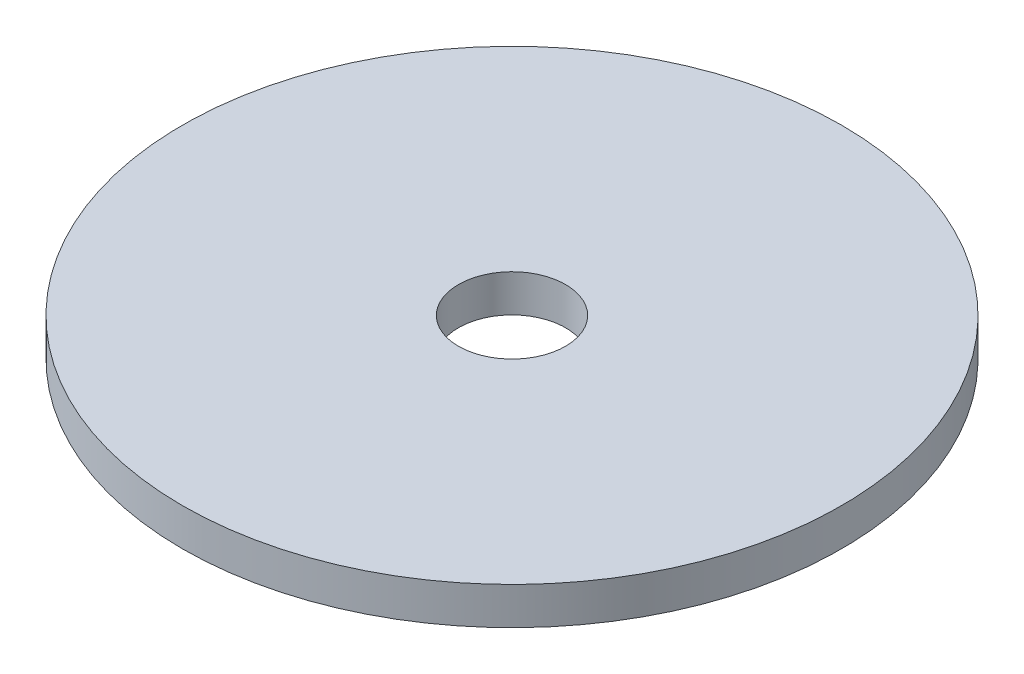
from build123d import *

# Parameters (mm, degrees)
SKETCH1_R           = 15.875
BOSS_EXTRUDE1_DEPTH = 1.8034
SKETCH5_R           = 2.5781
CUT_EXTRUDE1_DEPTH  = 23.522954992


with BuildPart() as part:
    # Sketch1 → Boss-Extrude1 (new body)
    with BuildSketch(Plane(origin=(0, 0, 0), x_dir=(1, 0, 0), z_dir=(0, 1, 0))):
        with Locations(Location((0, 0, 0), (0, 0, 270))):
            Circle(SKETCH1_R)
    extrude(amount=BOSS_EXTRUDE1_DEPTH)

    # Sketch5 → Cut-Extrude1 (cut, through all)
    with BuildSketch(Plane(origin=(0, 1.8034, 0), x_dir=(-1, 0, 0), z_dir=(0, 1, 0))):
        with Locations(Location((0, 0, 0), (0, 0, 90))):
            Circle(SKETCH5_R)
    extrude(amount=-CUT_EXTRUDE1_DEPTH, mode=Mode.SUBTRACT)


solid = part.part
